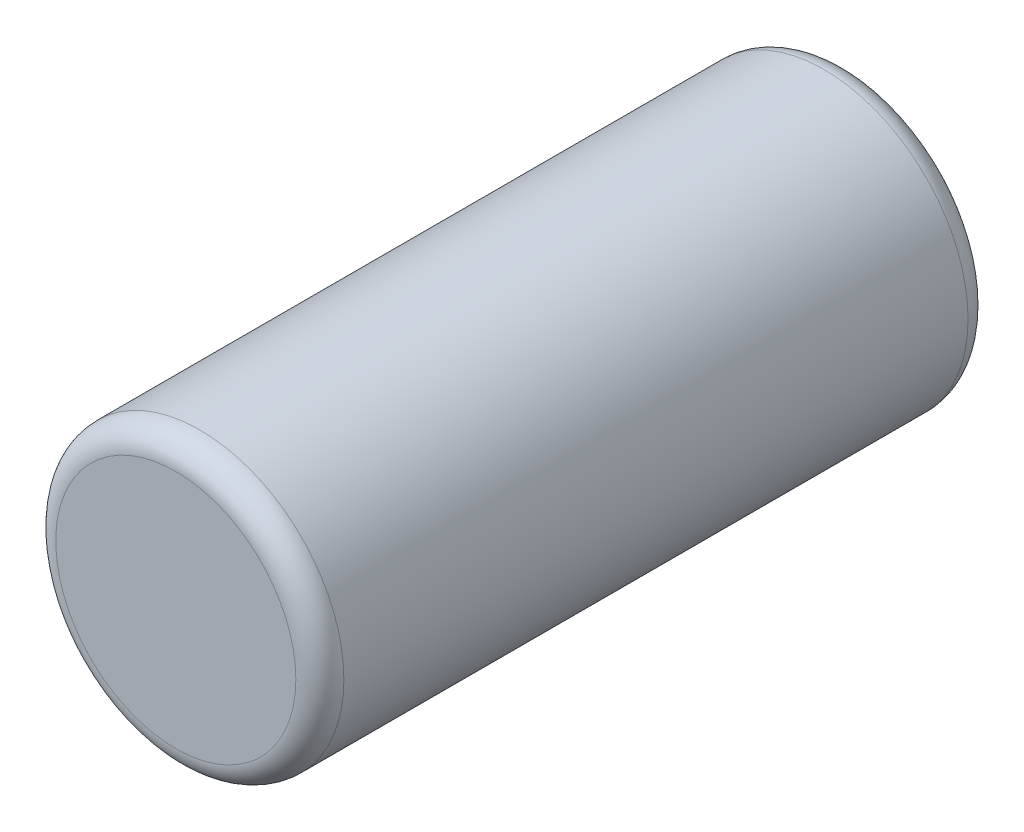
ISO-10303-21;
HEADER;
FILE_DESCRIPTION(('STEP AP214'),'2;1');
FILE_NAME('part.step','',(''),(''),'','','');
FILE_SCHEMA(('AUTOMOTIVE_DESIGN { 1 0 10303 214 1 1 1 1 }'));
ENDSEC;
DATA;
#1=APPLICATION_CONTEXT('core data for automotive mechanical design processes');
#2=APPLICATION_PROTOCOL_DEFINITION('international standard','automotive_design',2000,#1);
#3=PRODUCT_CONTEXT('',#1,'mechanical');
#4=PRODUCT('Part','Part','',(#3));
#5=PRODUCT_RELATED_PRODUCT_CATEGORY('part','',(#4));
#6=PRODUCT_DEFINITION_FORMATION('','',#4);
#7=PRODUCT_DEFINITION_CONTEXT('part definition',#1,'design');
#8=PRODUCT_DEFINITION('design','',#6,#7);
#9=PRODUCT_DEFINITION_SHAPE('','',#8);
#10=(LENGTH_UNIT() NAMED_UNIT(*) SI_UNIT(.MILLI.,.METRE.));
#11=(NAMED_UNIT(*) PLANE_ANGLE_UNIT() SI_UNIT($,.RADIAN.));
#12=(NAMED_UNIT(*) SI_UNIT($,.STERADIAN.) SOLID_ANGLE_UNIT());
#13=UNCERTAINTY_MEASURE_WITH_UNIT(LENGTH_MEASURE(1.E-05),#10,'distance_accuracy_value','');
#14=(GEOMETRIC_REPRESENTATION_CONTEXT(3) GLOBAL_UNCERTAINTY_ASSIGNED_CONTEXT((#13)) GLOBAL_UNIT_ASSIGNED_CONTEXT((#10,
#11,#12)) REPRESENTATION_CONTEXT('',''));
#15=CARTESIAN_POINT('',(0.,0.,0.));
#16=DIRECTION('',(0.,0.,1.));
#17=DIRECTION('',(1.,0.,0.));
#18=AXIS2_PLACEMENT_3D('',#15,#16,#17);
#19=CARTESIAN_POINT('',(0.,0.,280.));
#20=DIRECTION('',(0.,0.,-1.));
#21=DIRECTION('',(-1.,0.,0.));
#22=AXIS2_PLACEMENT_3D('',#19,#20,#21);
#23=CYLINDRICAL_SURFACE('',#22,60.);
#24=CARTESIAN_POINT('',(0.,0.,270.));
#25=DIRECTION('',(0.,0.,1.));
#26=DIRECTION('',(1.,0.,0.));
#27=AXIS2_PLACEMENT_3D('',#24,#25,#26);
#28=CIRCLE('',#27,60.);
#29=CARTESIAN_POINT('',(60.,0.,270.));
#30=VERTEX_POINT('',#29);
#31=EDGE_CURVE('E36',#30,#30,#28,.F.);
#32=ORIENTED_EDGE('',*,*,#31,.T.);
#33=EDGE_LOOP('',(#32));
#34=FACE_BOUND('',#33,.T.);
#35=CARTESIAN_POINT('',(0.,0.,10.));
#36=DIRECTION('',(0.,0.,1.));
#37=DIRECTION('',(1.,0.,0.));
#38=AXIS2_PLACEMENT_3D('',#35,#36,#37);
#39=CIRCLE('',#38,60.);
#40=CARTESIAN_POINT('',(60.,0.,10.));
#41=VERTEX_POINT('',#40);
#42=EDGE_CURVE('E40',#41,#41,#39,.T.);
#43=ORIENTED_EDGE('',*,*,#42,.T.);
#44=EDGE_LOOP('',(#43));
#45=FACE_BOUND('',#44,.T.);
#46=ADVANCED_FACE('F30',(#34,#45),#23,.T.);
#47=CARTESIAN_POINT('',(0.,0.,280.));
#48=DIRECTION('',(0.,0.,1.));
#49=DIRECTION('',(1.,0.,0.));
#50=AXIS2_PLACEMENT_3D('',#47,#48,#49);
#51=PLANE('',#50);
#52=CARTESIAN_POINT('',(0.,0.,280.));
#53=DIRECTION('',(0.,0.,1.));
#54=DIRECTION('',(1.,0.,0.));
#55=AXIS2_PLACEMENT_3D('',#52,#53,#54);
#56=CIRCLE('',#55,50.);
#57=CARTESIAN_POINT('',(50.,0.,280.));
#58=VERTEX_POINT('',#57);
#59=EDGE_CURVE('E44',#58,#58,#56,.T.);
#60=ORIENTED_EDGE('',*,*,#59,.T.);
#61=EDGE_LOOP('',(#60));
#62=FACE_BOUND('',#61,.T.);
#63=ADVANCED_FACE('F50',(#62),#51,.T.);
#64=CARTESIAN_POINT('',(0.,0.,0.));
#65=DIRECTION('',(0.,0.,1.));
#66=DIRECTION('',(1.,0.,0.));
#67=AXIS2_PLACEMENT_3D('',#64,#65,#66);
#68=PLANE('',#67);
#69=CARTESIAN_POINT('',(0.,0.,0.));
#70=DIRECTION('',(0.,0.,1.));
#71=DIRECTION('',(1.,0.,0.));
#72=AXIS2_PLACEMENT_3D('',#69,#70,#71);
#73=CIRCLE('',#72,50.);
#74=CARTESIAN_POINT('',(50.,0.,0.));
#75=VERTEX_POINT('',#74);
#76=EDGE_CURVE('E10',#75,#75,#73,.F.);
#77=ORIENTED_EDGE('',*,*,#76,.T.);
#78=EDGE_LOOP('',(#77));
#79=FACE_BOUND('',#78,.T.);
#80=ADVANCED_FACE('F55',(#79),#68,.F.);
#81=CARTESIAN_POINT('',(0.,0.,270.));
#82=DIRECTION('',(0.,0.,1.));
#83=DIRECTION('',(1.,0.,0.));
#84=AXIS2_PLACEMENT_3D('',#81,#82,#83);
#85=TOROIDAL_SURFACE('',#84,50.,10.);
#86=ORIENTED_EDGE('',*,*,#31,.F.);
#87=EDGE_LOOP('',(#86));
#88=FACE_BOUND('',#87,.T.);
#89=ORIENTED_EDGE('',*,*,#59,.F.);
#90=EDGE_LOOP('',(#89));
#91=FACE_BOUND('',#90,.T.);
#92=ADVANCED_FACE('F52',(#88,#91),#85,.T.);
#93=CARTESIAN_POINT('',(0.,0.,10.));
#94=DIRECTION('',(0.,0.,1.));
#95=DIRECTION('',(1.,0.,0.));
#96=AXIS2_PLACEMENT_3D('',#93,#94,#95);
#97=TOROIDAL_SURFACE('',#96,50.,10.);
#98=ORIENTED_EDGE('',*,*,#76,.F.);
#99=EDGE_LOOP('',(#98));
#100=FACE_BOUND('',#99,.T.);
#101=ORIENTED_EDGE('',*,*,#42,.F.);
#102=EDGE_LOOP('',(#101));
#103=FACE_BOUND('',#102,.T.);
#104=ADVANCED_FACE('F54',(#100,#103),#97,.T.);
#105=CLOSED_SHELL('',(#46,#63,#80,#92,#104));
#106=MANIFOLD_SOLID_BREP('B2',#105);
#107=ADVANCED_BREP_SHAPE_REPRESENTATION('',(#18,#106),#14);
#108=SHAPE_DEFINITION_REPRESENTATION(#9,#107);
ENDSEC;
END-ISO-10303-21;
